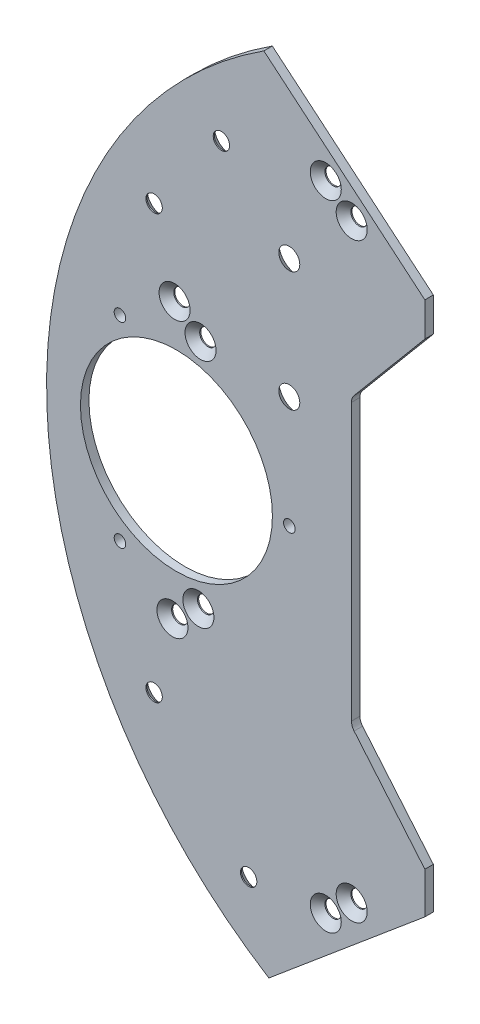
ISO-10303-21;
HEADER;
FILE_DESCRIPTION(('STEP AP214'),'2;1');
FILE_NAME('part.step','',(''),(''),'','','');
FILE_SCHEMA(('AUTOMOTIVE_DESIGN { 1 0 10303 214 1 1 1 1 }'));
ENDSEC;
DATA;
#1=APPLICATION_CONTEXT('core data for automotive mechanical design processes');
#2=APPLICATION_PROTOCOL_DEFINITION('international standard','automotive_design',2000,#1);
#3=PRODUCT_CONTEXT('',#1,'mechanical');
#4=PRODUCT('Part','Part','',(#3));
#5=PRODUCT_RELATED_PRODUCT_CATEGORY('part','',(#4));
#6=PRODUCT_DEFINITION_FORMATION('','',#4);
#7=PRODUCT_DEFINITION_CONTEXT('part definition',#1,'design');
#8=PRODUCT_DEFINITION('design','',#6,#7);
#9=PRODUCT_DEFINITION_SHAPE('','',#8);
#10=(LENGTH_UNIT() NAMED_UNIT(*) SI_UNIT(.MILLI.,.METRE.));
#11=(NAMED_UNIT(*) PLANE_ANGLE_UNIT() SI_UNIT($,.RADIAN.));
#12=(NAMED_UNIT(*) SI_UNIT($,.STERADIAN.) SOLID_ANGLE_UNIT());
#13=UNCERTAINTY_MEASURE_WITH_UNIT(LENGTH_MEASURE(1.E-05),#10,'distance_accuracy_value','');
#14=(GEOMETRIC_REPRESENTATION_CONTEXT(3) GLOBAL_UNCERTAINTY_ASSIGNED_CONTEXT((#13)) GLOBAL_UNIT_ASSIGNED_CONTEXT((#10,
#11,#12)) REPRESENTATION_CONTEXT('',''));
#15=CARTESIAN_POINT('',(0.,0.,0.));
#16=DIRECTION('',(0.,0.,1.));
#17=DIRECTION('',(1.,0.,0.));
#18=AXIS2_PLACEMENT_3D('',#15,#16,#17);
#19=CARTESIAN_POINT('',(0.,0.,0.));
#20=DIRECTION('',(0.,0.,1.));
#21=DIRECTION('',(1.,0.,0.));
#22=AXIS2_PLACEMENT_3D('',#19,#20,#21);
#23=PLANE('',#22);
#24=CARTESIAN_POINT('',(-41.0121933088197,19.7989898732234,0.));
#25=DIRECTION('',(0.,0.,-1.));
#26=DIRECTION('',(-1.,0.,0.));
#27=AXIS2_PLACEMENT_3D('',#24,#25,#26);
#28=CIRCLE('',#27,3.36);
#29=CARTESIAN_POINT('',(-44.3721933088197,19.7989898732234,0.));
#30=VERTEX_POINT('',#29);
#31=EDGE_CURVE('E644',#30,#30,#28,.T.);
#32=ORIENTED_EDGE('',*,*,#31,.F.);
#33=EDGE_LOOP('',(#32));
#34=FACE_BOUND('',#33,.T.);
#35=CARTESIAN_POINT('',(-41.0121933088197,41.0121933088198,0.));
#36=DIRECTION('',(0.,0.,-1.));
#37=DIRECTION('',(-1.,0.,0.));
#38=AXIS2_PLACEMENT_3D('',#35,#36,#37);
#39=CIRCLE('',#38,3.36);
#40=CARTESIAN_POINT('',(-44.3721933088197,41.0121933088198,0.));
#41=VERTEX_POINT('',#40);
#42=EDGE_CURVE('E636',#41,#41,#39,.T.);
#43=ORIENTED_EDGE('',*,*,#42,.F.);
#44=EDGE_LOOP('',(#43));
#45=FACE_BOUND('',#44,.T.);
#46=CARTESIAN_POINT('',(-48.2090707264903,-57.4533332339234,0.));
#47=DIRECTION('',(0.,0.,-1.));
#48=DIRECTION('',(-1.,0.,0.));
#49=AXIS2_PLACEMENT_3D('',#46,#47,#48);
#50=CIRCLE('',#49,2.75);
#51=CARTESIAN_POINT('',(-50.9590707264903,-57.4533332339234,0.));
#52=VERTEX_POINT('',#51);
#53=EDGE_CURVE('E301',#52,#52,#50,.T.);
#54=ORIENTED_EDGE('',*,*,#53,.F.);
#55=EDGE_LOOP('',(#54));
#56=FACE_BOUND('',#55,.T.);
#57=CARTESIAN_POINT('',(-64.9519052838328,-37.5000000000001,0.));
#58=DIRECTION('',(0.,0.,-1.));
#59=DIRECTION('',(-1.,0.,0.));
#60=AXIS2_PLACEMENT_3D('',#57,#58,#59);
#61=CIRCLE('',#60,2.75);
#62=CARTESIAN_POINT('',(-67.7019052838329,-37.5000000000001,0.));
#63=VERTEX_POINT('',#62);
#64=EDGE_CURVE('E305',#63,#63,#61,.T.);
#65=ORIENTED_EDGE('',*,*,#64,.F.);
#66=EDGE_LOOP('',(#65));
#67=FACE_BOUND('',#66,.T.);
#68=CARTESIAN_POINT('',(-64.9519052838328,37.5000000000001,0.));
#69=DIRECTION('',(0.,0.,-1.));
#70=DIRECTION('',(-1.,0.,0.));
#71=AXIS2_PLACEMENT_3D('',#68,#69,#70);
#72=CIRCLE('',#71,2.75);
#73=CARTESIAN_POINT('',(-67.7019052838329,37.5000000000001,0.));
#74=VERTEX_POINT('',#73);
#75=EDGE_CURVE('E320',#74,#74,#72,.T.);
#76=ORIENTED_EDGE('',*,*,#75,.F.);
#77=EDGE_LOOP('',(#76));
#78=FACE_BOUND('',#77,.T.);
#79=CARTESIAN_POINT('',(-61.7073994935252,-24.5935493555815,0.));
#80=DIRECTION('',(0.,0.,1.));
#81=DIRECTION('',(1.,0.,0.));
#82=AXIS2_PLACEMENT_3D('',#79,#80,#81);
#83=CIRCLE('',#82,1.44999999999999);
#84=CARTESIAN_POINT('',(-60.2573994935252,-24.5935493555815,0.));
#85=VERTEX_POINT('',#84);
#86=EDGE_CURVE('E346',#85,#85,#83,.T.);
#87=ORIENTED_EDGE('',*,*,#86,.T.);
#88=EDGE_LOOP('',(#87));
#89=FACE_BOUND('',#88,.T.);
#90=CARTESIAN_POINT('',(-57.1111328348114,-20.7368236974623,0.));
#91=DIRECTION('',(0.,0.,1.));
#92=DIRECTION('',(1.,0.,0.));
#93=AXIS2_PLACEMENT_3D('',#90,#91,#92);
#94=CIRCLE('',#93,1.44999999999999);
#95=CARTESIAN_POINT('',(-55.6611328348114,-20.7368236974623,0.));
#96=VERTEX_POINT('',#95);
#97=EDGE_CURVE('E358',#96,#96,#94,.T.);
#98=ORIENTED_EDGE('',*,*,#97,.T.);
#99=EDGE_LOOP('',(#98));
#100=FACE_BOUND('',#99,.T.);
#101=CARTESIAN_POINT('',(-29.9560066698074,-52.3211809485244,0.));
#102=DIRECTION('',(0.,0.,1.));
#103=DIRECTION('',(1.,0.,0.));
#104=AXIS2_PLACEMENT_3D('',#101,#102,#103);
#105=CIRCLE('',#104,1.44999999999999);
#106=CARTESIAN_POINT('',(-28.5060066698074,-52.3211809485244,0.));
#107=VERTEX_POINT('',#106);
#108=EDGE_CURVE('E370',#107,#107,#105,.T.);
#109=ORIENTED_EDGE('',*,*,#108,.T.);
#110=EDGE_LOOP('',(#109));
#111=FACE_BOUND('',#110,.T.);
#112=CARTESIAN_POINT('',(-34.5522733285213,-56.1779066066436,0.));
#113=DIRECTION('',(0.,0.,1.));
#114=DIRECTION('',(1.,0.,0.));
#115=AXIS2_PLACEMENT_3D('',#112,#113,#114);
#116=CIRCLE('',#115,1.44999999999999);
#117=CARTESIAN_POINT('',(-33.1022733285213,-56.1779066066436,0.));
#118=VERTEX_POINT('',#117);
#119=EDGE_CURVE('E382',#118,#118,#116,.T.);
#120=ORIENTED_EDGE('',*,*,#119,.T.);
#121=EDGE_LOOP('',(#120));
#122=FACE_BOUND('',#121,.T.);
#123=CARTESIAN_POINT('',(-34.5522733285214,56.1779066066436,0.));
#124=DIRECTION('',(0.,0.,1.));
#125=DIRECTION('',(1.,0.,0.));
#126=AXIS2_PLACEMENT_3D('',#123,#124,#125);
#127=CIRCLE('',#126,1.44999999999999);
#128=CARTESIAN_POINT('',(-33.1022733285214,56.1779066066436,0.));
#129=VERTEX_POINT('',#128);
#130=EDGE_CURVE('E394',#129,#129,#127,.T.);
#131=ORIENTED_EDGE('',*,*,#130,.T.);
#132=EDGE_LOOP('',(#131));
#133=FACE_BOUND('',#132,.T.);
#134=CARTESIAN_POINT('',(-29.9560066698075,52.3211809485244,0.));
#135=DIRECTION('',(0.,0.,1.));
#136=DIRECTION('',(1.,0.,0.));
#137=AXIS2_PLACEMENT_3D('',#134,#135,#136);
#138=CIRCLE('',#137,1.44999999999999);
#139=CARTESIAN_POINT('',(-28.5060066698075,52.3211809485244,0.));
#140=VERTEX_POINT('',#139);
#141=EDGE_CURVE('E406',#140,#140,#138,.T.);
#142=ORIENTED_EDGE('',*,*,#141,.T.);
#143=EDGE_LOOP('',(#142));
#144=FACE_BOUND('',#143,.T.);
#145=CARTESIAN_POINT('',(-61.3243772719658,24.2721555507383,0.));
#146=DIRECTION('',(0.,0.,1.));
#147=DIRECTION('',(1.,0.,0.));
#148=AXIS2_PLACEMENT_3D('',#145,#146,#147);
#149=CIRCLE('',#148,1.44999999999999);
#150=CARTESIAN_POINT('',(-59.8743772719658,24.2721555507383,0.));
#151=VERTEX_POINT('',#150);
#152=EDGE_CURVE('E418',#151,#151,#149,.T.);
#153=ORIENTED_EDGE('',*,*,#152,.T.);
#154=EDGE_LOOP('',(#153));
#155=FACE_BOUND('',#154,.T.);
#156=CARTESIAN_POINT('',(-56.7281106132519,20.415429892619,0.));
#157=DIRECTION('',(0.,0.,1.));
#158=DIRECTION('',(1.,0.,0.));
#159=AXIS2_PLACEMENT_3D('',#156,#157,#158);
#160=CIRCLE('',#159,1.44999999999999);
#161=CARTESIAN_POINT('',(-55.2781106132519,20.415429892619,0.));
#162=VERTEX_POINT('',#161);
#163=EDGE_CURVE('E430',#162,#162,#160,.T.);
#164=ORIENTED_EDGE('',*,*,#163,.T.);
#165=EDGE_LOOP('',(#164));
#166=FACE_BOUND('',#165,.T.);
#167=CARTESIAN_POINT('',(-71.,17.3205080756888,0.));
#168=DIRECTION('',(0.,0.,1.));
#169=DIRECTION('',(1.,0.,0.));
#170=AXIS2_PLACEMENT_3D('',#167,#168,#169);
#171=CIRCLE('',#170,1.025);
#172=CARTESIAN_POINT('',(-69.975,17.3205080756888,0.));
#173=VERTEX_POINT('',#172);
#174=EDGE_CURVE('E497',#173,#173,#171,.T.);
#175=ORIENTED_EDGE('',*,*,#174,.T.);
#176=EDGE_LOOP('',(#175));
#177=FACE_BOUND('',#176,.T.);
#178=CARTESIAN_POINT('',(-41.,0.,0.));
#179=DIRECTION('',(0.,0.,1.));
#180=DIRECTION('',(1.,0.,0.));
#181=AXIS2_PLACEMENT_3D('',#178,#179,#180);
#182=CIRCLE('',#181,1.025);
#183=CARTESIAN_POINT('',(-39.975,0.,0.));
#184=VERTEX_POINT('',#183);
#185=EDGE_CURVE('E505',#184,#184,#182,.T.);
#186=ORIENTED_EDGE('',*,*,#185,.T.);
#187=EDGE_LOOP('',(#186));
#188=FACE_BOUND('',#187,.T.);
#189=CARTESIAN_POINT('',(-71.,-17.3205080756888,0.));
#190=DIRECTION('',(0.,0.,1.));
#191=DIRECTION('',(1.,0.,0.));
#192=AXIS2_PLACEMENT_3D('',#189,#190,#191);
#193=CIRCLE('',#192,1.025);
#194=CARTESIAN_POINT('',(-69.975,-17.3205080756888,0.));
#195=VERTEX_POINT('',#194);
#196=EDGE_CURVE('E513',#195,#195,#193,.T.);
#197=ORIENTED_EDGE('',*,*,#196,.T.);
#198=EDGE_LOOP('',(#197));
#199=FACE_BOUND('',#198,.T.);
#200=CARTESIAN_POINT('',(-61.,0.,0.));
#201=DIRECTION('',(0.,0.,1.));
#202=DIRECTION('',(1.,0.,0.));
#203=AXIS2_PLACEMENT_3D('',#200,#201,#202);
#204=CIRCLE('',#203,17.);
#205=CARTESIAN_POINT('',(-44.,0.,0.));
#206=VERTEX_POINT('',#205);
#207=EDGE_CURVE('E518',#206,#206,#204,.T.);
#208=ORIENTED_EDGE('',*,*,#207,.T.);
#209=EDGE_LOOP('',(#208));
#210=FACE_BOUND('',#209,.T.);
#211=DIRECTION('',(0.766044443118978,0.642787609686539,0.));
#212=VECTOR('',#211,1.);
#213=CARTESIAN_POINT('',(-31.3383352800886,-60.0081288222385,0.));
#214=LINE('',#213,#212);
#215=CARTESIAN_POINT('',(-44.6312096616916,-71.1621748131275,0.));
#216=VERTEX_POINT('',#215);
#217=CARTESIAN_POINT('',(-17.,-47.97683697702,0.));
#218=VERTEX_POINT('',#217);
#219=EDGE_CURVE('E126',#216,#218,#214,.T.);
#220=ORIENTED_EDGE('',*,*,#219,.F.);
#221=CARTESIAN_POINT('',(0.,0.,0.));
#222=DIRECTION('',(0.,0.,1.));
#223=DIRECTION('',(-1.,0.,0.));
#224=AXIS2_PLACEMENT_3D('',#221,#222,#223);
#225=CIRCLE('',#224,84.);
#226=CARTESIAN_POINT('',(-45.5162264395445,70.5993847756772,0.));
#227=VERTEX_POINT('',#226);
#228=EDGE_CURVE('E123',#227,#216,#225,.T.);
#229=ORIENTED_EDGE('',*,*,#228,.F.);
#230=DIRECTION('',(-0.766044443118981,0.642787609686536,0.));
#231=VECTOR('',#230,1.);
#232=CARTESIAN_POINT('',(-31.9811228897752,59.2420843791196,0.));
#233=LINE('',#232,#231);
#234=CARTESIAN_POINT('',(-17.,46.6714296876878,0.));
#235=VERTEX_POINT('',#234);
#236=EDGE_CURVE('E624',#235,#227,#233,.T.);
#237=ORIENTED_EDGE('',*,*,#236,.F.);
#238=DIRECTION('',(0.,1.,0.));
#239=VECTOR('',#238,1.);
#240=CARTESIAN_POINT('',(-17.,85.3229160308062,0.));
#241=LINE('',#240,#239);
#242=CARTESIAN_POINT('',(-17.,40.6657856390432,0.));
#243=VERTEX_POINT('',#242);
#244=EDGE_CURVE('E522',#243,#235,#241,.T.);
#245=ORIENTED_EDGE('',*,*,#244,.F.);
#246=DIRECTION('',(-0.64278760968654,-0.766044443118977,0.));
#247=VECTOR('',#246,1.);
#248=CARTESIAN_POINT('',(-29.532088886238,25.7306236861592,0.));
#249=LINE('',#248,#247);
#250=CARTESIAN_POINT('',(-29.532088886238,25.7306236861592,0.));
#251=VERTEX_POINT('',#250);
#252=EDGE_CURVE('E435',#243,#251,#249,.T.);
#253=ORIENTED_EDGE('',*,*,#252,.T.);
#254=CARTESIAN_POINT('',(-28.,24.4450484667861,0.));
#255=DIRECTION('',(0.,0.,1.));
#256=DIRECTION('',(-1.,0.,0.));
#257=AXIS2_PLACEMENT_3D('',#254,#255,#256);
#258=CIRCLE('',#257,2.);
#259=CARTESIAN_POINT('',(-30.,24.4450484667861,0.));
#260=VERTEX_POINT('',#259);
#261=EDGE_CURVE('E439',#251,#260,#258,.T.);
#262=ORIENTED_EDGE('',*,*,#261,.T.);
#263=DIRECTION('',(0.,-1.,0.));
#264=VECTOR('',#263,1.);
#265=CARTESIAN_POINT('',(-30.,-24.4450484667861,0.));
#266=LINE('',#265,#264);
#267=CARTESIAN_POINT('',(-30.,-24.4450484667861,0.));
#268=VERTEX_POINT('',#267);
#269=EDGE_CURVE('E444',#260,#268,#266,.T.);
#270=ORIENTED_EDGE('',*,*,#269,.T.);
#271=CARTESIAN_POINT('',(-28.,-24.4450484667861,0.));
#272=DIRECTION('',(0.,0.,1.));
#273=DIRECTION('',(1.,0.,0.));
#274=AXIS2_PLACEMENT_3D('',#271,#272,#273);
#275=CIRCLE('',#274,2.);
#276=CARTESIAN_POINT('',(-29.5320888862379,-25.7306236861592,0.));
#277=VERTEX_POINT('',#276);
#278=EDGE_CURVE('E448',#268,#277,#275,.T.);
#279=ORIENTED_EDGE('',*,*,#278,.T.);
#280=DIRECTION('',(0.642787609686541,-0.766044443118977,0.));
#281=VECTOR('',#280,1.);
#282=CARTESIAN_POINT('',(-29.5320888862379,-25.7306236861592,0.));
#283=LINE('',#282,#281);
#284=CARTESIAN_POINT('',(-17.,-40.6657856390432,0.));
#285=VERTEX_POINT('',#284);
#286=EDGE_CURVE('E452',#277,#285,#283,.T.);
#287=ORIENTED_EDGE('',*,*,#286,.T.);
#288=EDGE_CURVE('E529',#218,#285,#241,.T.);
#289=ORIENTED_EDGE('',*,*,#288,.F.);
#290=EDGE_LOOP('',(#220,#229,#237,#245,#253,#262,#270,#279,#287,#289));
#291=FACE_BOUND('',#290,.T.);
#292=CARTESIAN_POINT('',(-53.033008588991,53.0330085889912,0.));
#293=DIRECTION('',(0.,0.,-1.));
#294=DIRECTION('',(-1.,0.,0.));
#295=AXIS2_PLACEMENT_3D('',#292,#293,#294);
#296=CIRCLE('',#295,2.75);
#297=CARTESIAN_POINT('',(-55.783008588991,53.0330085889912,0.));
#298=VERTEX_POINT('',#297);
#299=EDGE_CURVE('E329',#298,#298,#296,.T.);
#300=ORIENTED_EDGE('',*,*,#299,.F.);
#301=EDGE_LOOP('',(#300));
#302=FACE_BOUND('',#301,.T.);
#303=ADVANCED_FACE('F43',(#34,#45,#56,#67,#78,#89,#100,#111,#122,#133,#144,#155,#166,#177,#188,
#199,#210,#291,#302),#23,.F.);
#304=CARTESIAN_POINT('',(-17.,85.3229160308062,1.5));
#305=DIRECTION('',(-1.,0.,0.));
#306=DIRECTION('',(0.,0.,1.));
#307=AXIS2_PLACEMENT_3D('',#304,#305,#306);
#308=PLANE('',#307);
#309=DIRECTION('',(0.,1.,0.));
#310=VECTOR('',#309,1.);
#311=CARTESIAN_POINT('',(-17.,85.3229160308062,1.5));
#312=LINE('',#311,#310);
#313=CARTESIAN_POINT('',(-17.,-47.97683697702,1.5));
#314=VERTEX_POINT('',#313);
#315=CARTESIAN_POINT('',(-17.,-40.6657856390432,1.5));
#316=VERTEX_POINT('',#315);
#317=EDGE_CURVE('E53',#314,#316,#312,.T.);
#318=ORIENTED_EDGE('',*,*,#317,.F.);
#319=DIRECTION('',(0.,0.,-1.));
#320=VECTOR('',#319,1.);
#321=CARTESIAN_POINT('',(-17.,-47.97683697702,1.5));
#322=LINE('',#321,#320);
#323=EDGE_CURVE('E67',#314,#218,#322,.T.);
#324=ORIENTED_EDGE('',*,*,#323,.T.);
#325=ORIENTED_EDGE('',*,*,#288,.T.);
#326=DIRECTION('',(0.,0.,1.));
#327=VECTOR('',#326,1.);
#328=CARTESIAN_POINT('',(-17.,-40.6657856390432,0.));
#329=LINE('',#328,#327);
#330=EDGE_CURVE('E475',#285,#316,#329,.T.);
#331=ORIENTED_EDGE('',*,*,#330,.T.);
#332=EDGE_LOOP('',(#318,#324,#325,#331));
#333=FACE_BOUND('',#332,.T.);
#334=ADVANCED_FACE('F153',(#333),#308,.F.);
#335=ORIENTED_EDGE('',*,*,#244,.T.);
#336=DIRECTION('',(0.,0.,-1.));
#337=VECTOR('',#336,1.);
#338=CARTESIAN_POINT('',(-17.,46.6714296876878,1.5));
#339=LINE('',#338,#337);
#340=CARTESIAN_POINT('',(-17.,46.6714296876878,1.5));
#341=VERTEX_POINT('',#340);
#342=EDGE_CURVE('E308',#341,#235,#339,.T.);
#343=ORIENTED_EDGE('',*,*,#342,.F.);
#344=CARTESIAN_POINT('',(-17.,40.6657856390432,1.5));
#345=VERTEX_POINT('',#344);
#346=EDGE_CURVE('E528',#345,#341,#312,.T.);
#347=ORIENTED_EDGE('',*,*,#346,.F.);
#348=DIRECTION('',(0.,0.,1.));
#349=VECTOR('',#348,1.);
#350=CARTESIAN_POINT('',(-17.,40.6657856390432,0.));
#351=LINE('',#350,#349);
#352=EDGE_CURVE('E456',#243,#345,#351,.T.);
#353=ORIENTED_EDGE('',*,*,#352,.F.);
#354=EDGE_LOOP('',(#335,#343,#347,#353));
#355=FACE_BOUND('',#354,.T.);
#356=ADVANCED_FACE('F45',(#355),#308,.F.);
#357=CARTESIAN_POINT('',(0.,0.,1.5));
#358=DIRECTION('',(0.,0.,1.));
#359=DIRECTION('',(1.,0.,0.));
#360=AXIS2_PLACEMENT_3D('',#357,#358,#359);
#361=PLANE('',#360);
#362=CARTESIAN_POINT('',(-41.0121933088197,19.7989898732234,1.5));
#363=DIRECTION('',(0.,0.,1.));
#364=DIRECTION('',(1.,0.,0.));
#365=AXIS2_PLACEMENT_3D('',#362,#363,#364);
#366=CIRCLE('',#365,1.86);
#367=CARTESIAN_POINT('',(-39.1521933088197,19.7989898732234,1.5));
#368=VERTEX_POINT('',#367);
#369=EDGE_CURVE('E640',#368,#368,#366,.T.);
#370=ORIENTED_EDGE('',*,*,#369,.F.);
#371=EDGE_LOOP('',(#370));
#372=FACE_BOUND('',#371,.T.);
#373=CARTESIAN_POINT('',(-41.0121933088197,41.0121933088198,1.5));
#374=DIRECTION('',(0.,0.,1.));
#375=DIRECTION('',(1.,0.,0.));
#376=AXIS2_PLACEMENT_3D('',#373,#374,#375);
#377=CIRCLE('',#376,1.86);
#378=CARTESIAN_POINT('',(-39.1521933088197,41.0121933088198,1.5));
#379=VERTEX_POINT('',#378);
#380=EDGE_CURVE('E47',#379,#379,#377,.T.);
#381=ORIENTED_EDGE('',*,*,#380,.F.);
#382=EDGE_LOOP('',(#381));
#383=FACE_BOUND('',#382,.T.);
#384=CARTESIAN_POINT('',(0.,0.,1.5));
#385=DIRECTION('',(0.,0.,1.));
#386=DIRECTION('',(-1.,0.,0.));
#387=AXIS2_PLACEMENT_3D('',#384,#385,#386);
#388=CIRCLE('',#387,84.);
#389=CARTESIAN_POINT('',(-45.5162264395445,70.5993847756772,1.5));
#390=VERTEX_POINT('',#389);
#391=CARTESIAN_POINT('',(-44.6312096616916,-71.1621748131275,1.5));
#392=VERTEX_POINT('',#391);
#393=EDGE_CURVE('E60',#390,#392,#388,.T.);
#394=ORIENTED_EDGE('',*,*,#393,.T.);
#395=DIRECTION('',(-0.766044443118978,-0.642787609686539,0.));
#396=VECTOR('',#395,1.);
#397=CARTESIAN_POINT('',(16.599990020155,-19.7830977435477,1.5));
#398=LINE('',#397,#396);
#399=EDGE_CURVE('E11',#314,#392,#398,.T.);
#400=ORIENTED_EDGE('',*,*,#399,.F.);
#401=ORIENTED_EDGE('',*,*,#317,.T.);
#402=DIRECTION('',(0.642787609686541,-0.766044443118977,0.));
#403=VECTOR('',#402,1.);
#404=CARTESIAN_POINT('',(-29.5320888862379,-25.7306236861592,1.5));
#405=LINE('',#404,#403);
#406=CARTESIAN_POINT('',(-29.5320888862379,-25.7306236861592,1.5));
#407=VERTEX_POINT('',#406);
#408=EDGE_CURVE('E440',#407,#316,#405,.T.);
#409=ORIENTED_EDGE('',*,*,#408,.F.);
#410=CARTESIAN_POINT('',(-28.,-24.4450484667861,1.5));
#411=DIRECTION('',(0.,0.,1.));
#412=DIRECTION('',(1.,0.,0.));
#413=AXIS2_PLACEMENT_3D('',#410,#411,#412);
#414=CIRCLE('',#413,2.);
#415=CARTESIAN_POINT('',(-30.,-24.4450484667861,1.5));
#416=VERTEX_POINT('',#415);
#417=EDGE_CURVE('E468',#416,#407,#414,.T.);
#418=ORIENTED_EDGE('',*,*,#417,.F.);
#419=DIRECTION('',(0.,-1.,0.));
#420=VECTOR('',#419,1.);
#421=CARTESIAN_POINT('',(-30.,-24.4450484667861,1.5));
#422=LINE('',#421,#420);
#423=CARTESIAN_POINT('',(-30.,24.4450484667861,1.5));
#424=VERTEX_POINT('',#423);
#425=EDGE_CURVE('E464',#424,#416,#422,.T.);
#426=ORIENTED_EDGE('',*,*,#425,.F.);
#427=CARTESIAN_POINT('',(-28.,24.4450484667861,1.5));
#428=DIRECTION('',(0.,0.,1.));
#429=DIRECTION('',(-1.,0.,0.));
#430=AXIS2_PLACEMENT_3D('',#427,#428,#429);
#431=CIRCLE('',#430,2.);
#432=CARTESIAN_POINT('',(-29.532088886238,25.7306236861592,1.5));
#433=VERTEX_POINT('',#432);
#434=EDGE_CURVE('E460',#433,#424,#431,.T.);
#435=ORIENTED_EDGE('',*,*,#434,.F.);
#436=DIRECTION('',(-0.64278760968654,-0.766044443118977,0.));
#437=VECTOR('',#436,1.);
#438=CARTESIAN_POINT('',(-29.532088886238,25.7306236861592,1.5));
#439=LINE('',#438,#437);
#440=EDGE_CURVE('E434',#345,#433,#439,.T.);
#441=ORIENTED_EDGE('',*,*,#440,.F.);
#442=ORIENTED_EDGE('',*,*,#346,.T.);
#443=DIRECTION('',(-0.76604444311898,0.642787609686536,0.));
#444=VECTOR('',#443,1.);
#445=CARTESIAN_POINT('',(-63.0630477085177,85.3229160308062,1.5));
#446=LINE('',#445,#444);
#447=EDGE_CURVE('E135',#341,#390,#446,.T.);
#448=ORIENTED_EDGE('',*,*,#447,.T.);
#449=EDGE_LOOP('',(#394,#400,#401,#409,#418,#426,#435,#441,#442,#448));
#450=FACE_BOUND('',#449,.T.);
#451=CARTESIAN_POINT('',(-48.2090707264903,-57.4533332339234,1.5));
#452=DIRECTION('',(0.,0.,1.));
#453=DIRECTION('',(1.,0.,0.));
#454=AXIS2_PLACEMENT_3D('',#451,#452,#453);
#455=CIRCLE('',#454,1.44999999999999);
#456=CARTESIAN_POINT('',(-46.7590707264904,-57.4533332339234,1.5));
#457=VERTEX_POINT('',#456);
#458=EDGE_CURVE('E296',#457,#457,#455,.T.);
#459=ORIENTED_EDGE('',*,*,#458,.F.);
#460=EDGE_LOOP('',(#459));
#461=FACE_BOUND('',#460,.T.);
#462=CARTESIAN_POINT('',(-64.9519052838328,-37.5000000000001,1.5));
#463=DIRECTION('',(0.,0.,1.));
#464=DIRECTION('',(1.,0.,0.));
#465=AXIS2_PLACEMENT_3D('',#462,#463,#464);
#466=CIRCLE('',#465,1.44999999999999);
#467=CARTESIAN_POINT('',(-63.5019052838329,-37.5000000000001,1.5));
#468=VERTEX_POINT('',#467);
#469=EDGE_CURVE('E319',#468,#468,#466,.T.);
#470=ORIENTED_EDGE('',*,*,#469,.F.);
#471=EDGE_LOOP('',(#470));
#472=FACE_BOUND('',#471,.T.);
#473=CARTESIAN_POINT('',(-64.9519052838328,37.5000000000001,1.5));
#474=DIRECTION('',(0.,0.,1.));
#475=DIRECTION('',(1.,0.,0.));
#476=AXIS2_PLACEMENT_3D('',#473,#474,#475);
#477=CIRCLE('',#476,1.44999999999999);
#478=CARTESIAN_POINT('',(-63.5019052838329,37.5000000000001,1.5));
#479=VERTEX_POINT('',#478);
#480=EDGE_CURVE('E328',#479,#479,#477,.T.);
#481=ORIENTED_EDGE('',*,*,#480,.F.);
#482=EDGE_LOOP('',(#481));
#483=FACE_BOUND('',#482,.T.);
#484=CARTESIAN_POINT('',(-53.033008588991,53.0330085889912,1.5));
#485=DIRECTION('',(0.,0.,1.));
#486=DIRECTION('',(1.,0.,0.));
#487=AXIS2_PLACEMENT_3D('',#484,#485,#486);
#488=CIRCLE('',#487,1.44999999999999);
#489=CARTESIAN_POINT('',(-51.583008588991,53.0330085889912,1.5));
#490=VERTEX_POINT('',#489);
#491=EDGE_CURVE('E337',#490,#490,#488,.T.);
#492=ORIENTED_EDGE('',*,*,#491,.F.);
#493=EDGE_LOOP('',(#492));
#494=FACE_BOUND('',#493,.T.);
#495=CARTESIAN_POINT('',(-61.7073994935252,-24.5935493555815,1.5));
#496=DIRECTION('',(0.,0.,1.));
#497=DIRECTION('',(1.,0.,0.));
#498=AXIS2_PLACEMENT_3D('',#495,#496,#497);
#499=CIRCLE('',#498,2.75);
#500=CARTESIAN_POINT('',(-58.9573994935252,-24.5935493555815,1.5));
#501=VERTEX_POINT('',#500);
#502=EDGE_CURVE('E338',#501,#501,#499,.T.);
#503=ORIENTED_EDGE('',*,*,#502,.F.);
#504=EDGE_LOOP('',(#503));
#505=FACE_BOUND('',#504,.T.);
#506=CARTESIAN_POINT('',(-57.1111328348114,-20.7368236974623,1.5));
#507=DIRECTION('',(0.,0.,1.));
#508=DIRECTION('',(1.,0.,0.));
#509=AXIS2_PLACEMENT_3D('',#506,#507,#508);
#510=CIRCLE('',#509,2.75);
#511=CARTESIAN_POINT('',(-54.3611328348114,-20.7368236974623,1.5));
#512=VERTEX_POINT('',#511);
#513=EDGE_CURVE('E350',#512,#512,#510,.T.);
#514=ORIENTED_EDGE('',*,*,#513,.F.);
#515=EDGE_LOOP('',(#514));
#516=FACE_BOUND('',#515,.T.);
#517=CARTESIAN_POINT('',(-29.9560066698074,-52.3211809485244,1.5));
#518=DIRECTION('',(0.,0.,1.));
#519=DIRECTION('',(1.,0.,0.));
#520=AXIS2_PLACEMENT_3D('',#517,#518,#519);
#521=CIRCLE('',#520,2.75);
#522=CARTESIAN_POINT('',(-27.2060066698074,-52.3211809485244,1.5));
#523=VERTEX_POINT('',#522);
#524=EDGE_CURVE('E362',#523,#523,#521,.T.);
#525=ORIENTED_EDGE('',*,*,#524,.F.);
#526=EDGE_LOOP('',(#525));
#527=FACE_BOUND('',#526,.T.);
#528=CARTESIAN_POINT('',(-34.5522733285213,-56.1779066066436,1.5));
#529=DIRECTION('',(0.,0.,1.));
#530=DIRECTION('',(1.,0.,0.));
#531=AXIS2_PLACEMENT_3D('',#528,#529,#530);
#532=CIRCLE('',#531,2.75);
#533=CARTESIAN_POINT('',(-31.8022733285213,-56.1779066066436,1.5));
#534=VERTEX_POINT('',#533);
#535=EDGE_CURVE('E374',#534,#534,#532,.T.);
#536=ORIENTED_EDGE('',*,*,#535,.F.);
#537=EDGE_LOOP('',(#536));
#538=FACE_BOUND('',#537,.T.);
#539=CARTESIAN_POINT('',(-34.5522733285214,56.1779066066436,1.5));
#540=DIRECTION('',(0.,0.,1.));
#541=DIRECTION('',(1.,0.,0.));
#542=AXIS2_PLACEMENT_3D('',#539,#540,#541);
#543=CIRCLE('',#542,2.75);
#544=CARTESIAN_POINT('',(-31.8022733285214,56.1779066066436,1.5));
#545=VERTEX_POINT('',#544);
#546=EDGE_CURVE('E386',#545,#545,#543,.T.);
#547=ORIENTED_EDGE('',*,*,#546,.F.);
#548=EDGE_LOOP('',(#547));
#549=FACE_BOUND('',#548,.T.);
#550=CARTESIAN_POINT('',(-29.9560066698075,52.3211809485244,1.5));
#551=DIRECTION('',(0.,0.,1.));
#552=DIRECTION('',(1.,0.,0.));
#553=AXIS2_PLACEMENT_3D('',#550,#551,#552);
#554=CIRCLE('',#553,2.75);
#555=CARTESIAN_POINT('',(-27.2060066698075,52.3211809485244,1.5));
#556=VERTEX_POINT('',#555);
#557=EDGE_CURVE('E398',#556,#556,#554,.T.);
#558=ORIENTED_EDGE('',*,*,#557,.F.);
#559=EDGE_LOOP('',(#558));
#560=FACE_BOUND('',#559,.T.);
#561=CARTESIAN_POINT('',(-61.3243772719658,24.2721555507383,1.5));
#562=DIRECTION('',(0.,0.,1.));
#563=DIRECTION('',(1.,0.,0.));
#564=AXIS2_PLACEMENT_3D('',#561,#562,#563);
#565=CIRCLE('',#564,2.75);
#566=CARTESIAN_POINT('',(-58.5743772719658,24.2721555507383,1.5));
#567=VERTEX_POINT('',#566);
#568=EDGE_CURVE('E410',#567,#567,#565,.T.);
#569=ORIENTED_EDGE('',*,*,#568,.F.);
#570=EDGE_LOOP('',(#569));
#571=FACE_BOUND('',#570,.T.);
#572=CARTESIAN_POINT('',(-56.7281106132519,20.415429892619,1.5));
#573=DIRECTION('',(0.,0.,1.));
#574=DIRECTION('',(1.,0.,0.));
#575=AXIS2_PLACEMENT_3D('',#572,#573,#574);
#576=CIRCLE('',#575,2.75);
#577=CARTESIAN_POINT('',(-53.9781106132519,20.415429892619,1.5));
#578=VERTEX_POINT('',#577);
#579=EDGE_CURVE('E422',#578,#578,#576,.T.);
#580=ORIENTED_EDGE('',*,*,#579,.F.);
#581=EDGE_LOOP('',(#580));
#582=FACE_BOUND('',#581,.T.);
#583=CARTESIAN_POINT('',(-71.,17.3205080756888,1.5));
#584=DIRECTION('',(0.,0.,1.));
#585=DIRECTION('',(1.,0.,0.));
#586=AXIS2_PLACEMENT_3D('',#583,#584,#585);
#587=CIRCLE('',#586,1.025);
#588=CARTESIAN_POINT('',(-69.975,17.3205080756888,1.5));
#589=VERTEX_POINT('',#588);
#590=EDGE_CURVE('E479',#589,#589,#587,.T.);
#591=ORIENTED_EDGE('',*,*,#590,.F.);
#592=EDGE_LOOP('',(#591));
#593=FACE_BOUND('',#592,.T.);
#594=CARTESIAN_POINT('',(-41.,0.,1.5));
#595=DIRECTION('',(0.,0.,1.));
#596=DIRECTION('',(1.,0.,0.));
#597=AXIS2_PLACEMENT_3D('',#594,#595,#596);
#598=CIRCLE('',#597,1.025);
#599=CARTESIAN_POINT('',(-39.975,0.,1.5));
#600=VERTEX_POINT('',#599);
#601=EDGE_CURVE('E501',#600,#600,#598,.T.);
#602=ORIENTED_EDGE('',*,*,#601,.F.);
#603=EDGE_LOOP('',(#602));
#604=FACE_BOUND('',#603,.T.);
#605=CARTESIAN_POINT('',(-71.,-17.3205080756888,1.5));
#606=DIRECTION('',(0.,0.,1.));
#607=DIRECTION('',(1.,0.,0.));
#608=AXIS2_PLACEMENT_3D('',#605,#606,#607);
#609=CIRCLE('',#608,1.025);
#610=CARTESIAN_POINT('',(-69.975,-17.3205080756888,1.5));
#611=VERTEX_POINT('',#610);
#612=EDGE_CURVE('E509',#611,#611,#609,.T.);
#613=ORIENTED_EDGE('',*,*,#612,.F.);
#614=EDGE_LOOP('',(#613));
#615=FACE_BOUND('',#614,.T.);
#616=CARTESIAN_POINT('',(-61.,0.,1.5));
#617=DIRECTION('',(0.,0.,1.));
#618=DIRECTION('',(1.,0.,0.));
#619=AXIS2_PLACEMENT_3D('',#616,#617,#618);
#620=CIRCLE('',#619,17.);
#621=CARTESIAN_POINT('',(-44.,0.,1.5));
#622=VERTEX_POINT('',#621);
#623=EDGE_CURVE('E517',#622,#622,#620,.T.);
#624=ORIENTED_EDGE('',*,*,#623,.F.);
#625=EDGE_LOOP('',(#624));
#626=FACE_BOUND('',#625,.T.);
#627=ADVANCED_FACE('F131',(#372,#383,#450,#461,#472,#483,#494,#505,#516,#527,#538,#549,#560,
#571,#582,#593,#604,#615,#626),#361,.T.);
#628=CARTESIAN_POINT('',(-61.,0.,0.));
#629=DIRECTION('',(0.,0.,1.));
#630=DIRECTION('',(1.,0.,0.));
#631=AXIS2_PLACEMENT_3D('',#628,#629,#630);
#632=CYLINDRICAL_SURFACE('',#631,17.);
#633=ORIENTED_EDGE('',*,*,#207,.F.);
#634=EDGE_LOOP('',(#633));
#635=FACE_BOUND('',#634,.T.);
#636=ORIENTED_EDGE('',*,*,#623,.T.);
#637=EDGE_LOOP('',(#636));
#638=FACE_BOUND('',#637,.T.);
#639=ADVANCED_FACE('F164',(#635,#638),#632,.F.);
#640=CARTESIAN_POINT('',(-71.,-17.3205080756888,1.5));
#641=DIRECTION('',(0.,0.,1.));
#642=DIRECTION('',(1.,0.,0.));
#643=AXIS2_PLACEMENT_3D('',#640,#641,#642);
#644=CYLINDRICAL_SURFACE('',#643,1.025);
#645=ORIENTED_EDGE('',*,*,#196,.F.);
#646=EDGE_LOOP('',(#645));
#647=FACE_BOUND('',#646,.T.);
#648=ORIENTED_EDGE('',*,*,#612,.T.);
#649=EDGE_LOOP('',(#648));
#650=FACE_BOUND('',#649,.T.);
#651=ADVANCED_FACE('F168',(#647,#650),#644,.F.);
#652=CARTESIAN_POINT('',(-41.,0.,1.5));
#653=DIRECTION('',(0.,0.,1.));
#654=DIRECTION('',(1.,0.,0.));
#655=AXIS2_PLACEMENT_3D('',#652,#653,#654);
#656=CYLINDRICAL_SURFACE('',#655,1.025);
#657=ORIENTED_EDGE('',*,*,#185,.F.);
#658=EDGE_LOOP('',(#657));
#659=FACE_BOUND('',#658,.T.);
#660=ORIENTED_EDGE('',*,*,#601,.T.);
#661=EDGE_LOOP('',(#660));
#662=FACE_BOUND('',#661,.T.);
#663=ADVANCED_FACE('F172',(#659,#662),#656,.F.);
#664=CARTESIAN_POINT('',(-71.,17.3205080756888,1.5));
#665=DIRECTION('',(0.,0.,1.));
#666=DIRECTION('',(1.,0.,0.));
#667=AXIS2_PLACEMENT_3D('',#664,#665,#666);
#668=CYLINDRICAL_SURFACE('',#667,1.025);
#669=ORIENTED_EDGE('',*,*,#174,.F.);
#670=EDGE_LOOP('',(#669));
#671=FACE_BOUND('',#670,.T.);
#672=ORIENTED_EDGE('',*,*,#590,.T.);
#673=EDGE_LOOP('',(#672));
#674=FACE_BOUND('',#673,.T.);
#675=ADVANCED_FACE('F176',(#671,#674),#668,.F.);
#676=CARTESIAN_POINT('',(-29.5320888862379,-25.7306236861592,0.));
#677=DIRECTION('',(-0.766044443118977,-0.642787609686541,0.));
#678=DIRECTION('',(0.642787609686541,-0.766044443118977,0.));
#679=AXIS2_PLACEMENT_3D('',#676,#677,#678);
#680=PLANE('',#679);
#681=ORIENTED_EDGE('',*,*,#408,.T.);
#682=ORIENTED_EDGE('',*,*,#330,.F.);
#683=ORIENTED_EDGE('',*,*,#286,.F.);
#684=DIRECTION('',(0.,0.,1.));
#685=VECTOR('',#684,1.);
#686=CARTESIAN_POINT('',(-29.5320888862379,-25.7306236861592,0.));
#687=LINE('',#686,#685);
#688=EDGE_CURVE('E480',#277,#407,#687,.T.);
#689=ORIENTED_EDGE('',*,*,#688,.T.);
#690=EDGE_LOOP('',(#681,#682,#683,#689));
#691=FACE_BOUND('',#690,.T.);
#692=ADVANCED_FACE('F180',(#691),#680,.F.);
#693=CARTESIAN_POINT('',(-28.,-24.4450484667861,0.));
#694=DIRECTION('',(0.,0.,1.));
#695=DIRECTION('',(1.,0.,0.));
#696=AXIS2_PLACEMENT_3D('',#693,#694,#695);
#697=CYLINDRICAL_SURFACE('',#696,2.);
#698=ORIENTED_EDGE('',*,*,#417,.T.);
#699=ORIENTED_EDGE('',*,*,#688,.F.);
#700=ORIENTED_EDGE('',*,*,#278,.F.);
#701=DIRECTION('',(0.,0.,1.));
#702=VECTOR('',#701,1.);
#703=CARTESIAN_POINT('',(-30.,-24.4450484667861,0.));
#704=LINE('',#703,#702);
#705=EDGE_CURVE('E483',#268,#416,#704,.T.);
#706=ORIENTED_EDGE('',*,*,#705,.T.);
#707=EDGE_LOOP('',(#698,#699,#700,#706));
#708=FACE_BOUND('',#707,.T.);
#709=ADVANCED_FACE('F194',(#708),#697,.F.);
#710=CARTESIAN_POINT('',(-30.,-24.4450484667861,0.));
#711=DIRECTION('',(-1.,0.,0.));
#712=DIRECTION('',(0.,-1.,0.));
#713=AXIS2_PLACEMENT_3D('',#710,#711,#712);
#714=PLANE('',#713);
#715=ORIENTED_EDGE('',*,*,#425,.T.);
#716=ORIENTED_EDGE('',*,*,#705,.F.);
#717=ORIENTED_EDGE('',*,*,#269,.F.);
#718=DIRECTION('',(0.,0.,1.));
#719=VECTOR('',#718,1.);
#720=CARTESIAN_POINT('',(-30.,24.4450484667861,0.));
#721=LINE('',#720,#719);
#722=EDGE_CURVE('E486',#260,#424,#721,.T.);
#723=ORIENTED_EDGE('',*,*,#722,.T.);
#724=EDGE_LOOP('',(#715,#716,#717,#723));
#725=FACE_BOUND('',#724,.T.);
#726=ADVANCED_FACE('F190',(#725),#714,.F.);
#727=CARTESIAN_POINT('',(-28.,24.4450484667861,0.));
#728=DIRECTION('',(0.,0.,1.));
#729=DIRECTION('',(1.,0.,0.));
#730=AXIS2_PLACEMENT_3D('',#727,#728,#729);
#731=CYLINDRICAL_SURFACE('',#730,2.);
#732=ORIENTED_EDGE('',*,*,#434,.T.);
#733=ORIENTED_EDGE('',*,*,#722,.F.);
#734=ORIENTED_EDGE('',*,*,#261,.F.);
#735=DIRECTION('',(0.,0.,1.));
#736=VECTOR('',#735,1.);
#737=CARTESIAN_POINT('',(-29.532088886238,25.7306236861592,0.));
#738=LINE('',#737,#736);
#739=EDGE_CURVE('E489',#251,#433,#738,.T.);
#740=ORIENTED_EDGE('',*,*,#739,.T.);
#741=EDGE_LOOP('',(#732,#733,#734,#740));
#742=FACE_BOUND('',#741,.T.);
#743=ADVANCED_FACE('F186',(#742),#731,.F.);
#744=CARTESIAN_POINT('',(-29.532088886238,25.7306236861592,0.));
#745=DIRECTION('',(-0.766044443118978,0.64278760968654,0.));
#746=DIRECTION('',(-0.64278760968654,-0.766044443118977,0.));
#747=AXIS2_PLACEMENT_3D('',#744,#745,#746);
#748=PLANE('',#747);
#749=ORIENTED_EDGE('',*,*,#440,.T.);
#750=ORIENTED_EDGE('',*,*,#739,.F.);
#751=ORIENTED_EDGE('',*,*,#252,.F.);
#752=ORIENTED_EDGE('',*,*,#352,.T.);
#753=EDGE_LOOP('',(#749,#750,#751,#752));
#754=FACE_BOUND('',#753,.T.);
#755=ADVANCED_FACE('F182',(#754),#748,.F.);
#756=CARTESIAN_POINT('',(-56.7281106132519,20.415429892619,1.5));
#757=DIRECTION('',(0.,0.,1.));
#758=DIRECTION('',(1.,0.,0.));
#759=AXIS2_PLACEMENT_3D('',#756,#757,#758);
#760=CYLINDRICAL_SURFACE('',#759,1.44999999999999);
#761=ORIENTED_EDGE('',*,*,#163,.F.);
#762=EDGE_LOOP('',(#761));
#763=FACE_BOUND('',#762,.T.);
#764=CARTESIAN_POINT('',(-56.7281106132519,20.415429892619,0.199999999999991));
#765=DIRECTION('',(0.,0.,1.));
#766=DIRECTION('',(1.,0.,0.));
#767=AXIS2_PLACEMENT_3D('',#764,#765,#766);
#768=CIRCLE('',#767,1.44999999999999);
#769=CARTESIAN_POINT('',(-55.2781106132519,20.415429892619,0.199999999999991));
#770=VERTEX_POINT('',#769);
#771=EDGE_CURVE('E426',#770,#770,#768,.T.);
#772=ORIENTED_EDGE('',*,*,#771,.T.);
#773=EDGE_LOOP('',(#772));
#774=FACE_BOUND('',#773,.T.);
#775=ADVANCED_FACE('F185',(#763,#774),#760,.F.);
#776=CARTESIAN_POINT('',(-56.7281106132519,20.415429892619,1.5));
#777=DIRECTION('',(0.,0.,1.));
#778=DIRECTION('',(1.,0.,0.));
#779=AXIS2_PLACEMENT_3D('',#776,#777,#778);
#780=CONICAL_SURFACE('',#779,2.75,0.785398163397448);
#781=ORIENTED_EDGE('',*,*,#771,.F.);
#782=EDGE_LOOP('',(#781));
#783=FACE_BOUND('',#782,.T.);
#784=ORIENTED_EDGE('',*,*,#579,.T.);
#785=EDGE_LOOP('',(#784));
#786=FACE_BOUND('',#785,.T.);
#787=ADVANCED_FACE('F204',(#783,#786),#780,.F.);
#788=CARTESIAN_POINT('',(-61.3243772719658,24.2721555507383,1.5));
#789=DIRECTION('',(0.,0.,1.));
#790=DIRECTION('',(1.,0.,0.));
#791=AXIS2_PLACEMENT_3D('',#788,#789,#790);
#792=CYLINDRICAL_SURFACE('',#791,1.44999999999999);
#793=ORIENTED_EDGE('',*,*,#152,.F.);
#794=EDGE_LOOP('',(#793));
#795=FACE_BOUND('',#794,.T.);
#796=CARTESIAN_POINT('',(-61.3243772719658,24.2721555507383,0.199999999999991));
#797=DIRECTION('',(0.,0.,1.));
#798=DIRECTION('',(1.,0.,0.));
#799=AXIS2_PLACEMENT_3D('',#796,#797,#798);
#800=CIRCLE('',#799,1.44999999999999);
#801=CARTESIAN_POINT('',(-59.8743772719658,24.2721555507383,0.199999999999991));
#802=VERTEX_POINT('',#801);
#803=EDGE_CURVE('E414',#802,#802,#800,.T.);
#804=ORIENTED_EDGE('',*,*,#803,.T.);
#805=EDGE_LOOP('',(#804));
#806=FACE_BOUND('',#805,.T.);
#807=ADVANCED_FACE('F208',(#795,#806),#792,.F.);
#808=CARTESIAN_POINT('',(-61.3243772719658,24.2721555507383,1.5));
#809=DIRECTION('',(0.,0.,1.));
#810=DIRECTION('',(1.,0.,0.));
#811=AXIS2_PLACEMENT_3D('',#808,#809,#810);
#812=CONICAL_SURFACE('',#811,2.75,0.785398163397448);
#813=ORIENTED_EDGE('',*,*,#803,.F.);
#814=EDGE_LOOP('',(#813));
#815=FACE_BOUND('',#814,.T.);
#816=ORIENTED_EDGE('',*,*,#568,.T.);
#817=EDGE_LOOP('',(#816));
#818=FACE_BOUND('',#817,.T.);
#819=ADVANCED_FACE('F212',(#815,#818),#812,.F.);
#820=CARTESIAN_POINT('',(-29.9560066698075,52.3211809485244,1.5));
#821=DIRECTION('',(0.,0.,1.));
#822=DIRECTION('',(1.,0.,0.));
#823=AXIS2_PLACEMENT_3D('',#820,#821,#822);
#824=CYLINDRICAL_SURFACE('',#823,1.44999999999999);
#825=ORIENTED_EDGE('',*,*,#141,.F.);
#826=EDGE_LOOP('',(#825));
#827=FACE_BOUND('',#826,.T.);
#828=CARTESIAN_POINT('',(-29.9560066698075,52.3211809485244,0.199999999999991));
#829=DIRECTION('',(0.,0.,1.));
#830=DIRECTION('',(1.,0.,0.));
#831=AXIS2_PLACEMENT_3D('',#828,#829,#830);
#832=CIRCLE('',#831,1.44999999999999);
#833=CARTESIAN_POINT('',(-28.5060066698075,52.3211809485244,0.199999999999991));
#834=VERTEX_POINT('',#833);
#835=EDGE_CURVE('E402',#834,#834,#832,.T.);
#836=ORIENTED_EDGE('',*,*,#835,.T.);
#837=EDGE_LOOP('',(#836));
#838=FACE_BOUND('',#837,.T.);
#839=ADVANCED_FACE('F216',(#827,#838),#824,.F.);
#840=CARTESIAN_POINT('',(-29.9560066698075,52.3211809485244,1.5));
#841=DIRECTION('',(0.,0.,1.));
#842=DIRECTION('',(1.,0.,0.));
#843=AXIS2_PLACEMENT_3D('',#840,#841,#842);
#844=CONICAL_SURFACE('',#843,2.75,0.785398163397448);
#845=ORIENTED_EDGE('',*,*,#835,.F.);
#846=EDGE_LOOP('',(#845));
#847=FACE_BOUND('',#846,.T.);
#848=ORIENTED_EDGE('',*,*,#557,.T.);
#849=EDGE_LOOP('',(#848));
#850=FACE_BOUND('',#849,.T.);
#851=ADVANCED_FACE('F220',(#847,#850),#844,.F.);
#852=CARTESIAN_POINT('',(-34.5522733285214,56.1779066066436,1.5));
#853=DIRECTION('',(0.,0.,1.));
#854=DIRECTION('',(1.,0.,0.));
#855=AXIS2_PLACEMENT_3D('',#852,#853,#854);
#856=CYLINDRICAL_SURFACE('',#855,1.44999999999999);
#857=ORIENTED_EDGE('',*,*,#130,.F.);
#858=EDGE_LOOP('',(#857));
#859=FACE_BOUND('',#858,.T.);
#860=CARTESIAN_POINT('',(-34.5522733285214,56.1779066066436,0.199999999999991));
#861=DIRECTION('',(0.,0.,1.));
#862=DIRECTION('',(1.,0.,0.));
#863=AXIS2_PLACEMENT_3D('',#860,#861,#862);
#864=CIRCLE('',#863,1.44999999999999);
#865=CARTESIAN_POINT('',(-33.1022733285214,56.1779066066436,0.199999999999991));
#866=VERTEX_POINT('',#865);
#867=EDGE_CURVE('E390',#866,#866,#864,.T.);
#868=ORIENTED_EDGE('',*,*,#867,.T.);
#869=EDGE_LOOP('',(#868));
#870=FACE_BOUND('',#869,.T.);
#871=ADVANCED_FACE('F224',(#859,#870),#856,.F.);
#872=CARTESIAN_POINT('',(-34.5522733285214,56.1779066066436,1.5));
#873=DIRECTION('',(0.,0.,1.));
#874=DIRECTION('',(1.,0.,0.));
#875=AXIS2_PLACEMENT_3D('',#872,#873,#874);
#876=CONICAL_SURFACE('',#875,2.75,0.785398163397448);
#877=ORIENTED_EDGE('',*,*,#867,.F.);
#878=EDGE_LOOP('',(#877));
#879=FACE_BOUND('',#878,.T.);
#880=ORIENTED_EDGE('',*,*,#546,.T.);
#881=EDGE_LOOP('',(#880));
#882=FACE_BOUND('',#881,.T.);
#883=ADVANCED_FACE('F228',(#879,#882),#876,.F.);
#884=CARTESIAN_POINT('',(-34.5522733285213,-56.1779066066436,1.5));
#885=DIRECTION('',(0.,0.,1.));
#886=DIRECTION('',(1.,0.,0.));
#887=AXIS2_PLACEMENT_3D('',#884,#885,#886);
#888=CYLINDRICAL_SURFACE('',#887,1.44999999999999);
#889=ORIENTED_EDGE('',*,*,#119,.F.);
#890=EDGE_LOOP('',(#889));
#891=FACE_BOUND('',#890,.T.);
#892=CARTESIAN_POINT('',(-34.5522733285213,-56.1779066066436,0.199999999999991));
#893=DIRECTION('',(0.,0.,1.));
#894=DIRECTION('',(1.,0.,0.));
#895=AXIS2_PLACEMENT_3D('',#892,#893,#894);
#896=CIRCLE('',#895,1.44999999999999);
#897=CARTESIAN_POINT('',(-33.1022733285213,-56.1779066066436,0.199999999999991));
#898=VERTEX_POINT('',#897);
#899=EDGE_CURVE('E378',#898,#898,#896,.T.);
#900=ORIENTED_EDGE('',*,*,#899,.T.);
#901=EDGE_LOOP('',(#900));
#902=FACE_BOUND('',#901,.T.);
#903=ADVANCED_FACE('F232',(#891,#902),#888,.F.);
#904=CARTESIAN_POINT('',(-34.5522733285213,-56.1779066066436,1.5));
#905=DIRECTION('',(0.,0.,1.));
#906=DIRECTION('',(1.,0.,0.));
#907=AXIS2_PLACEMENT_3D('',#904,#905,#906);
#908=CONICAL_SURFACE('',#907,2.75,0.785398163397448);
#909=ORIENTED_EDGE('',*,*,#899,.F.);
#910=EDGE_LOOP('',(#909));
#911=FACE_BOUND('',#910,.T.);
#912=ORIENTED_EDGE('',*,*,#535,.T.);
#913=EDGE_LOOP('',(#912));
#914=FACE_BOUND('',#913,.T.);
#915=ADVANCED_FACE('F236',(#911,#914),#908,.F.);
#916=CARTESIAN_POINT('',(-29.9560066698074,-52.3211809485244,1.5));
#917=DIRECTION('',(0.,0.,1.));
#918=DIRECTION('',(1.,0.,0.));
#919=AXIS2_PLACEMENT_3D('',#916,#917,#918);
#920=CYLINDRICAL_SURFACE('',#919,1.44999999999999);
#921=ORIENTED_EDGE('',*,*,#108,.F.);
#922=EDGE_LOOP('',(#921));
#923=FACE_BOUND('',#922,.T.);
#924=CARTESIAN_POINT('',(-29.9560066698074,-52.3211809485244,0.199999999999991));
#925=DIRECTION('',(0.,0.,1.));
#926=DIRECTION('',(1.,0.,0.));
#927=AXIS2_PLACEMENT_3D('',#924,#925,#926);
#928=CIRCLE('',#927,1.44999999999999);
#929=CARTESIAN_POINT('',(-28.5060066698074,-52.3211809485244,0.199999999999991));
#930=VERTEX_POINT('',#929);
#931=EDGE_CURVE('E366',#930,#930,#928,.T.);
#932=ORIENTED_EDGE('',*,*,#931,.T.);
#933=EDGE_LOOP('',(#932));
#934=FACE_BOUND('',#933,.T.);
#935=ADVANCED_FACE('F240',(#923,#934),#920,.F.);
#936=CARTESIAN_POINT('',(-29.9560066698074,-52.3211809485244,1.5));
#937=DIRECTION('',(0.,0.,1.));
#938=DIRECTION('',(1.,0.,0.));
#939=AXIS2_PLACEMENT_3D('',#936,#937,#938);
#940=CONICAL_SURFACE('',#939,2.75,0.785398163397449);
#941=ORIENTED_EDGE('',*,*,#931,.F.);
#942=EDGE_LOOP('',(#941));
#943=FACE_BOUND('',#942,.T.);
#944=ORIENTED_EDGE('',*,*,#524,.T.);
#945=EDGE_LOOP('',(#944));
#946=FACE_BOUND('',#945,.T.);
#947=ADVANCED_FACE('F244',(#943,#946),#940,.F.);
#948=CARTESIAN_POINT('',(-57.1111328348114,-20.7368236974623,1.5));
#949=DIRECTION('',(0.,0.,1.));
#950=DIRECTION('',(1.,0.,0.));
#951=AXIS2_PLACEMENT_3D('',#948,#949,#950);
#952=CYLINDRICAL_SURFACE('',#951,1.44999999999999);
#953=ORIENTED_EDGE('',*,*,#97,.F.);
#954=EDGE_LOOP('',(#953));
#955=FACE_BOUND('',#954,.T.);
#956=CARTESIAN_POINT('',(-57.1111328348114,-20.7368236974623,0.199999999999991));
#957=DIRECTION('',(0.,0.,1.));
#958=DIRECTION('',(1.,0.,0.));
#959=AXIS2_PLACEMENT_3D('',#956,#957,#958);
#960=CIRCLE('',#959,1.44999999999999);
#961=CARTESIAN_POINT('',(-55.6611328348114,-20.7368236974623,0.199999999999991));
#962=VERTEX_POINT('',#961);
#963=EDGE_CURVE('E354',#962,#962,#960,.T.);
#964=ORIENTED_EDGE('',*,*,#963,.T.);
#965=EDGE_LOOP('',(#964));
#966=FACE_BOUND('',#965,.T.);
#967=ADVANCED_FACE('F248',(#955,#966),#952,.F.);
#968=CARTESIAN_POINT('',(-57.1111328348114,-20.7368236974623,1.5));
#969=DIRECTION('',(0.,0.,1.));
#970=DIRECTION('',(1.,0.,0.));
#971=AXIS2_PLACEMENT_3D('',#968,#969,#970);
#972=CONICAL_SURFACE('',#971,2.75,0.78539816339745);
#973=ORIENTED_EDGE('',*,*,#963,.F.);
#974=EDGE_LOOP('',(#973));
#975=FACE_BOUND('',#974,.T.);
#976=ORIENTED_EDGE('',*,*,#513,.T.);
#977=EDGE_LOOP('',(#976));
#978=FACE_BOUND('',#977,.T.);
#979=ADVANCED_FACE('F252',(#975,#978),#972,.F.);
#980=CARTESIAN_POINT('',(-61.7073994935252,-24.5935493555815,1.5));
#981=DIRECTION('',(0.,0.,1.));
#982=DIRECTION('',(1.,0.,0.));
#983=AXIS2_PLACEMENT_3D('',#980,#981,#982);
#984=CYLINDRICAL_SURFACE('',#983,1.44999999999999);
#985=ORIENTED_EDGE('',*,*,#86,.F.);
#986=EDGE_LOOP('',(#985));
#987=FACE_BOUND('',#986,.T.);
#988=CARTESIAN_POINT('',(-61.7073994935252,-24.5935493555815,0.199999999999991));
#989=DIRECTION('',(0.,0.,1.));
#990=DIRECTION('',(1.,0.,0.));
#991=AXIS2_PLACEMENT_3D('',#988,#989,#990);
#992=CIRCLE('',#991,1.44999999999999);
#993=CARTESIAN_POINT('',(-60.2573994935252,-24.5935493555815,0.199999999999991));
#994=VERTEX_POINT('',#993);
#995=EDGE_CURVE('E342',#994,#994,#992,.T.);
#996=ORIENTED_EDGE('',*,*,#995,.T.);
#997=EDGE_LOOP('',(#996));
#998=FACE_BOUND('',#997,.T.);
#999=ADVANCED_FACE('F256',(#987,#998),#984,.F.);
#1000=CARTESIAN_POINT('',(-61.7073994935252,-24.5935493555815,1.5));
#1001=DIRECTION('',(0.,0.,1.));
#1002=DIRECTION('',(1.,0.,0.));
#1003=AXIS2_PLACEMENT_3D('',#1000,#1001,#1002);
#1004=CONICAL_SURFACE('',#1003,2.75,0.785398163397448);
#1005=ORIENTED_EDGE('',*,*,#995,.F.);
#1006=EDGE_LOOP('',(#1005));
#1007=FACE_BOUND('',#1006,.T.);
#1008=ORIENTED_EDGE('',*,*,#502,.T.);
#1009=EDGE_LOOP('',(#1008));
#1010=FACE_BOUND('',#1009,.T.);
#1011=ADVANCED_FACE('F260',(#1007,#1010),#1004,.F.);
#1012=CARTESIAN_POINT('',(-53.033008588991,53.0330085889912,0.));
#1013=DIRECTION('',(0.,0.,-1.));
#1014=DIRECTION('',(-1.,0.,0.));
#1015=AXIS2_PLACEMENT_3D('',#1012,#1013,#1014);
#1016=CYLINDRICAL_SURFACE('',#1015,1.44999999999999);
#1017=ORIENTED_EDGE('',*,*,#491,.T.);
#1018=EDGE_LOOP('',(#1017));
#1019=FACE_BOUND('',#1018,.T.);
#1020=CARTESIAN_POINT('',(-53.033008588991,53.0330085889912,1.30000000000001));
#1021=DIRECTION('',(0.,0.,-1.));
#1022=DIRECTION('',(-1.,0.,0.));
#1023=AXIS2_PLACEMENT_3D('',#1020,#1021,#1022);
#1024=CIRCLE('',#1023,1.44999999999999);
#1025=CARTESIAN_POINT('',(-54.4830085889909,53.0330085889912,1.30000000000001));
#1026=VERTEX_POINT('',#1025);
#1027=EDGE_CURVE('E333',#1026,#1026,#1024,.T.);
#1028=ORIENTED_EDGE('',*,*,#1027,.T.);
#1029=EDGE_LOOP('',(#1028));
#1030=FACE_BOUND('',#1029,.T.);
#1031=ADVANCED_FACE('F264',(#1019,#1030),#1016,.F.);
#1032=CARTESIAN_POINT('',(-53.033008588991,53.0330085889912,0.));
#1033=DIRECTION('',(0.,0.,-1.));
#1034=DIRECTION('',(-1.,0.,0.));
#1035=AXIS2_PLACEMENT_3D('',#1032,#1033,#1034);
#1036=CONICAL_SURFACE('',#1035,2.75,0.78539816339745);
#1037=ORIENTED_EDGE('',*,*,#1027,.F.);
#1038=EDGE_LOOP('',(#1037));
#1039=FACE_BOUND('',#1038,.T.);
#1040=ORIENTED_EDGE('',*,*,#299,.T.);
#1041=EDGE_LOOP('',(#1040));
#1042=FACE_BOUND('',#1041,.T.);
#1043=ADVANCED_FACE('F268',(#1039,#1042),#1036,.F.);
#1044=CARTESIAN_POINT('',(-64.9519052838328,37.5000000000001,0.));
#1045=DIRECTION('',(0.,0.,-1.));
#1046=DIRECTION('',(-1.,0.,0.));
#1047=AXIS2_PLACEMENT_3D('',#1044,#1045,#1046);
#1048=CYLINDRICAL_SURFACE('',#1047,1.44999999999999);
#1049=ORIENTED_EDGE('',*,*,#480,.T.);
#1050=EDGE_LOOP('',(#1049));
#1051=FACE_BOUND('',#1050,.T.);
#1052=CARTESIAN_POINT('',(-64.9519052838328,37.5000000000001,1.30000000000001));
#1053=DIRECTION('',(0.,0.,-1.));
#1054=DIRECTION('',(-1.,0.,0.));
#1055=AXIS2_PLACEMENT_3D('',#1052,#1053,#1054);
#1056=CIRCLE('',#1055,1.44999999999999);
#1057=CARTESIAN_POINT('',(-66.4019052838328,37.5000000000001,1.30000000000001));
#1058=VERTEX_POINT('',#1057);
#1059=EDGE_CURVE('E324',#1058,#1058,#1056,.T.);
#1060=ORIENTED_EDGE('',*,*,#1059,.T.);
#1061=EDGE_LOOP('',(#1060));
#1062=FACE_BOUND('',#1061,.T.);
#1063=ADVANCED_FACE('F272',(#1051,#1062),#1048,.F.);
#1064=CARTESIAN_POINT('',(-64.9519052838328,37.5000000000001,0.));
#1065=DIRECTION('',(0.,0.,-1.));
#1066=DIRECTION('',(-1.,0.,0.));
#1067=AXIS2_PLACEMENT_3D('',#1064,#1065,#1066);
#1068=CONICAL_SURFACE('',#1067,2.75,0.785398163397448);
#1069=ORIENTED_EDGE('',*,*,#1059,.F.);
#1070=EDGE_LOOP('',(#1069));
#1071=FACE_BOUND('',#1070,.T.);
#1072=ORIENTED_EDGE('',*,*,#75,.T.);
#1073=EDGE_LOOP('',(#1072));
#1074=FACE_BOUND('',#1073,.T.);
#1075=ADVANCED_FACE('F276',(#1071,#1074),#1068,.F.);
#1076=CARTESIAN_POINT('',(-64.9519052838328,-37.5000000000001,0.));
#1077=DIRECTION('',(0.,0.,-1.));
#1078=DIRECTION('',(-1.,0.,0.));
#1079=AXIS2_PLACEMENT_3D('',#1076,#1077,#1078);
#1080=CYLINDRICAL_SURFACE('',#1079,1.44999999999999);
#1081=ORIENTED_EDGE('',*,*,#469,.T.);
#1082=EDGE_LOOP('',(#1081));
#1083=FACE_BOUND('',#1082,.T.);
#1084=CARTESIAN_POINT('',(-64.9519052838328,-37.5000000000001,1.30000000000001));
#1085=DIRECTION('',(0.,0.,-1.));
#1086=DIRECTION('',(-1.,0.,0.));
#1087=AXIS2_PLACEMENT_3D('',#1084,#1085,#1086);
#1088=CIRCLE('',#1087,1.44999999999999);
#1089=CARTESIAN_POINT('',(-66.4019052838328,-37.5000000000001,1.30000000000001));
#1090=VERTEX_POINT('',#1089);
#1091=EDGE_CURVE('E315',#1090,#1090,#1088,.T.);
#1092=ORIENTED_EDGE('',*,*,#1091,.T.);
#1093=EDGE_LOOP('',(#1092));
#1094=FACE_BOUND('',#1093,.T.);
#1095=ADVANCED_FACE('F280',(#1083,#1094),#1080,.F.);
#1096=CARTESIAN_POINT('',(-64.9519052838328,-37.5000000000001,0.));
#1097=DIRECTION('',(0.,0.,-1.));
#1098=DIRECTION('',(-1.,0.,0.));
#1099=AXIS2_PLACEMENT_3D('',#1096,#1097,#1098);
#1100=CONICAL_SURFACE('',#1099,2.75,0.785398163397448);
#1101=ORIENTED_EDGE('',*,*,#1091,.F.);
#1102=EDGE_LOOP('',(#1101));
#1103=FACE_BOUND('',#1102,.T.);
#1104=ORIENTED_EDGE('',*,*,#64,.T.);
#1105=EDGE_LOOP('',(#1104));
#1106=FACE_BOUND('',#1105,.T.);
#1107=ADVANCED_FACE('F284',(#1103,#1106),#1100,.F.);
#1108=CARTESIAN_POINT('',(-48.2090707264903,-57.4533332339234,0.));
#1109=DIRECTION('',(0.,0.,-1.));
#1110=DIRECTION('',(-1.,0.,0.));
#1111=AXIS2_PLACEMENT_3D('',#1108,#1109,#1110);
#1112=CYLINDRICAL_SURFACE('',#1111,1.44999999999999);
#1113=ORIENTED_EDGE('',*,*,#458,.T.);
#1114=EDGE_LOOP('',(#1113));
#1115=FACE_BOUND('',#1114,.T.);
#1116=CARTESIAN_POINT('',(-48.2090707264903,-57.4533332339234,1.30000000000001));
#1117=DIRECTION('',(0.,0.,-1.));
#1118=DIRECTION('',(-1.,0.,0.));
#1119=AXIS2_PLACEMENT_3D('',#1116,#1117,#1118);
#1120=CIRCLE('',#1119,1.44999999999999);
#1121=CARTESIAN_POINT('',(-49.6590707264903,-57.4533332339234,1.30000000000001));
#1122=VERTEX_POINT('',#1121);
#1123=EDGE_CURVE('E299',#1122,#1122,#1120,.T.);
#1124=ORIENTED_EDGE('',*,*,#1123,.T.);
#1125=EDGE_LOOP('',(#1124));
#1126=FACE_BOUND('',#1125,.T.);
#1127=ADVANCED_FACE('F149',(#1115,#1126),#1112,.F.);
#1128=CARTESIAN_POINT('',(-48.2090707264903,-57.4533332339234,0.));
#1129=DIRECTION('',(0.,0.,-1.));
#1130=DIRECTION('',(-1.,0.,0.));
#1131=AXIS2_PLACEMENT_3D('',#1128,#1129,#1130);
#1132=CONICAL_SURFACE('',#1131,2.75,0.785398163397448);
#1133=ORIENTED_EDGE('',*,*,#1123,.F.);
#1134=EDGE_LOOP('',(#1133));
#1135=FACE_BOUND('',#1134,.T.);
#1136=ORIENTED_EDGE('',*,*,#53,.T.);
#1137=EDGE_LOOP('',(#1136));
#1138=FACE_BOUND('',#1137,.T.);
#1139=ADVANCED_FACE('F141',(#1135,#1138),#1132,.F.);
#1140=CARTESIAN_POINT('',(-31.3383352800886,-60.0081288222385,1.5));
#1141=DIRECTION('',(-0.642787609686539,0.766044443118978,0.));
#1142=DIRECTION('',(-0.766044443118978,-0.642787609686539,0.));
#1143=AXIS2_PLACEMENT_3D('',#1140,#1141,#1142);
#1144=PLANE('',#1143);
#1145=ORIENTED_EDGE('',*,*,#399,.T.);
#1146=DIRECTION('',(0.,0.,-1.));
#1147=VECTOR('',#1146,1.);
#1148=CARTESIAN_POINT('',(-44.6312096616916,-71.1621748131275,1.5));
#1149=LINE('',#1148,#1147);
#1150=EDGE_CURVE('E120',#392,#216,#1149,.T.);
#1151=ORIENTED_EDGE('',*,*,#1150,.T.);
#1152=ORIENTED_EDGE('',*,*,#219,.T.);
#1153=ORIENTED_EDGE('',*,*,#323,.F.);
#1154=EDGE_LOOP('',(#1145,#1151,#1152,#1153));
#1155=FACE_BOUND('',#1154,.T.);
#1156=ADVANCED_FACE('F138',(#1155),#1144,.F.);
#1157=CARTESIAN_POINT('',(-31.9811228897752,59.2420843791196,1.5));
#1158=DIRECTION('',(-0.642787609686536,-0.766044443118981,0.));
#1159=DIRECTION('',(0.766044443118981,-0.642787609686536,0.));
#1160=AXIS2_PLACEMENT_3D('',#1157,#1158,#1159);
#1161=PLANE('',#1160);
#1162=ORIENTED_EDGE('',*,*,#236,.T.);
#1163=DIRECTION('',(0.,0.,-1.));
#1164=VECTOR('',#1163,1.);
#1165=CARTESIAN_POINT('',(-45.5162264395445,70.5993847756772,1.5));
#1166=LINE('',#1165,#1164);
#1167=EDGE_CURVE('E127',#390,#227,#1166,.T.);
#1168=ORIENTED_EDGE('',*,*,#1167,.F.);
#1169=ORIENTED_EDGE('',*,*,#447,.F.);
#1170=ORIENTED_EDGE('',*,*,#342,.T.);
#1171=EDGE_LOOP('',(#1162,#1168,#1169,#1170));
#1172=FACE_BOUND('',#1171,.T.);
#1173=ADVANCED_FACE('F140',(#1172),#1161,.F.);
#1174=CARTESIAN_POINT('',(0.,0.,1.5));
#1175=DIRECTION('',(0.,0.,-1.));
#1176=DIRECTION('',(-1.,0.,0.));
#1177=AXIS2_PLACEMENT_3D('',#1174,#1175,#1176);
#1178=CYLINDRICAL_SURFACE('',#1177,84.);
#1179=ORIENTED_EDGE('',*,*,#228,.T.);
#1180=ORIENTED_EDGE('',*,*,#1150,.F.);
#1181=ORIENTED_EDGE('',*,*,#393,.F.);
#1182=ORIENTED_EDGE('',*,*,#1167,.T.);
#1183=EDGE_LOOP('',(#1179,#1180,#1181,#1182));
#1184=FACE_BOUND('',#1183,.T.);
#1185=ADVANCED_FACE('F121',(#1184),#1178,.T.);
#1186=CARTESIAN_POINT('',(-41.0121933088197,41.0121933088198,0.));
#1187=DIRECTION('',(0.,0.,-1.));
#1188=DIRECTION('',(-1.,0.,0.));
#1189=AXIS2_PLACEMENT_3D('',#1186,#1187,#1188);
#1190=CONICAL_SURFACE('',#1189,3.36,0.785398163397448);
#1191=ORIENTED_EDGE('',*,*,#380,.T.);
#1192=EDGE_LOOP('',(#1191));
#1193=FACE_BOUND('',#1192,.T.);
#1194=ORIENTED_EDGE('',*,*,#42,.T.);
#1195=EDGE_LOOP('',(#1194));
#1196=FACE_BOUND('',#1195,.T.);
#1197=ADVANCED_FACE('F650',(#1193,#1196),#1190,.F.);
#1198=CARTESIAN_POINT('',(-41.0121933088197,19.7989898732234,0.));
#1199=DIRECTION('',(0.,0.,-1.));
#1200=DIRECTION('',(-1.,0.,0.));
#1201=AXIS2_PLACEMENT_3D('',#1198,#1199,#1200);
#1202=CONICAL_SURFACE('',#1201,3.36,0.785398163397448);
#1203=ORIENTED_EDGE('',*,*,#369,.T.);
#1204=EDGE_LOOP('',(#1203));
#1205=FACE_BOUND('',#1204,.T.);
#1206=ORIENTED_EDGE('',*,*,#31,.T.);
#1207=EDGE_LOOP('',(#1206));
#1208=FACE_BOUND('',#1207,.T.);
#1209=ADVANCED_FACE('F648',(#1205,#1208),#1202,.F.);
#1210=CLOSED_SHELL('',(#303,#334,#356,#627,#639,#651,#663,#675,#692,#709,#726,#743,#755,#775,
#787,#807,#819,#839,#851,#871,#883,#903,#915,#935,#947,#967,#979,#999,#1011,#1031,#1043,#1063,
#1075,#1095,#1107,#1127,#1139,#1156,#1173,#1185,#1197,#1209));
#1211=MANIFOLD_SOLID_BREP('B2',#1210);
#1212=ADVANCED_BREP_SHAPE_REPRESENTATION('',(#18,#1211),#14);
#1213=SHAPE_DEFINITION_REPRESENTATION(#9,#1212);
ENDSEC;
END-ISO-10303-21;
